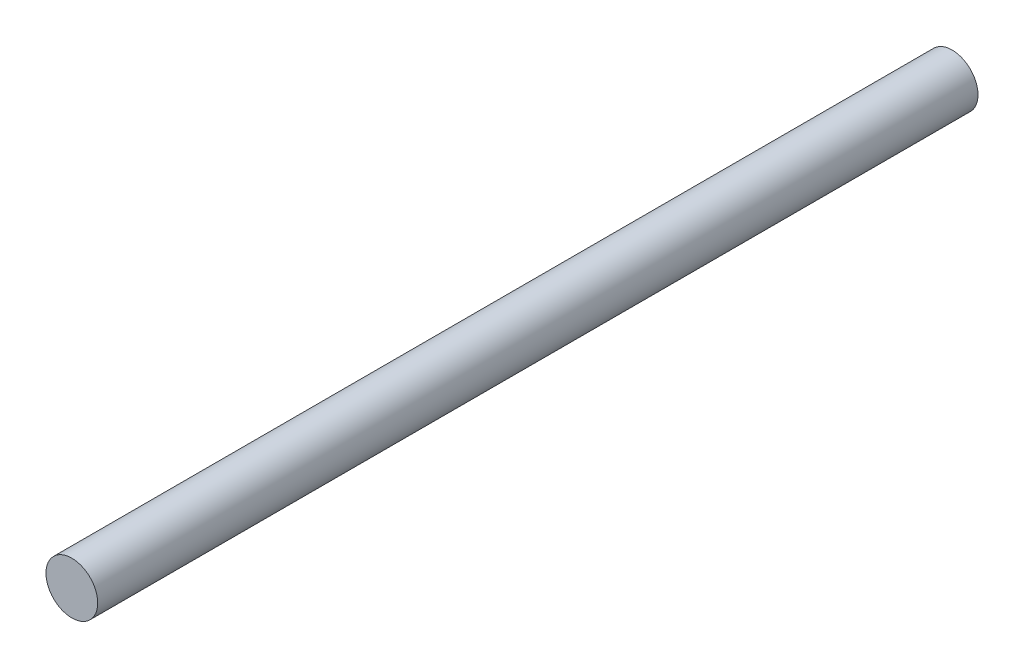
from build123d import *

# Parameters (mm, degrees)
SKETCH1_R      = 5
EXTRUDE1_DEPTH = 85


with BuildPart() as part:
    # Sketch1 → Extrude1 (new, symmetric)
    with BuildSketch(Plane.XY):
        Circle(SKETCH1_R)
    extrude(amount=EXTRUDE1_DEPTH, both=True)


solid = part.part
